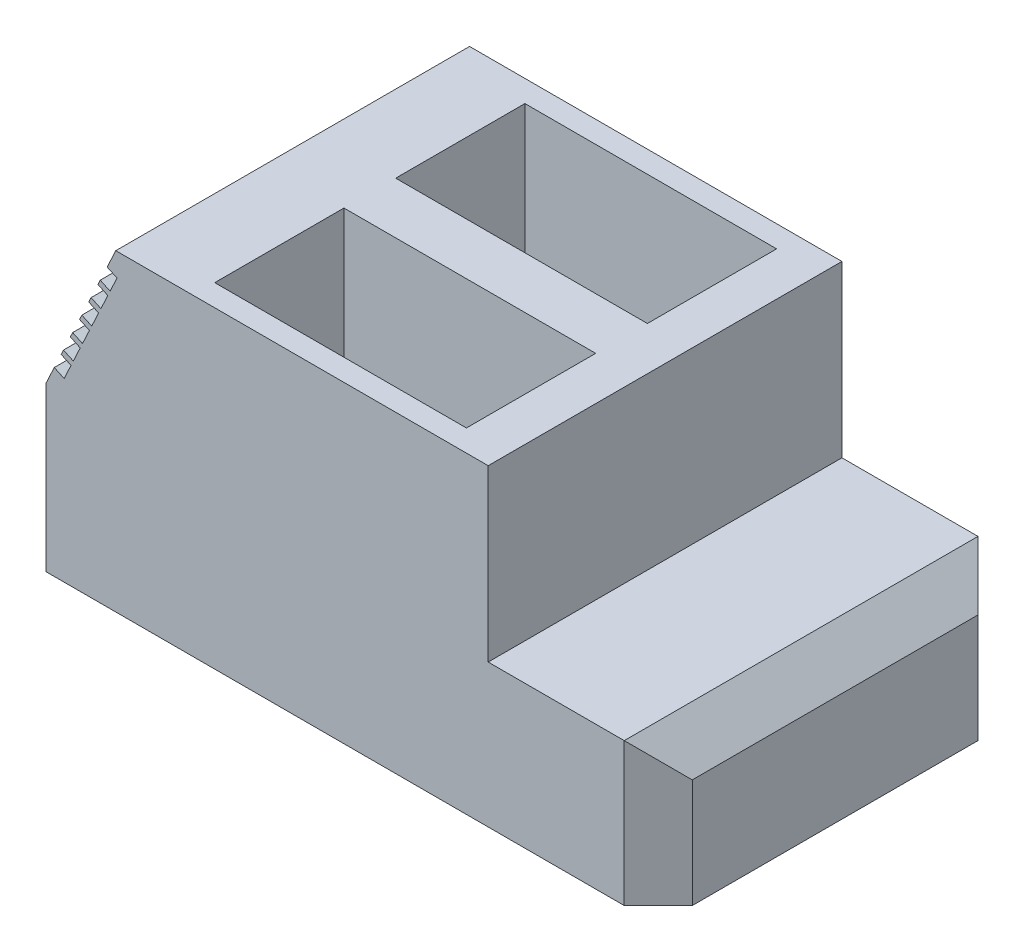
from build123d import *

# Parameters (mm, degrees)
BOSS_EXTRUDE1_DEPTH  = 130
SKETCH2_W            = 185
SKETCH2_H            = 95
CUT_EXTRUDE1_DEPTH   = 348.023053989
CUT_EXTRUDE2_DEPTH   = 80
LPATTERN1_COUNT      = 6
LPATTERN1_PITCH      = 16
MIRROR1_COPY_1_DEPTH = 80
MIRROR1_COPY_2_DEPTH = 80
MIRROR1_COPY_3_DEPTH = 80
MIRROR1_COPY_4_DEPTH = 80
MIRROR1_COPY_5_DEPTH = 80
CHAMFER1_SIZE        = 25
SKETCH7_W            = 80
SKETCH7_H            = 160
SKETCH7_W_2          = 50
SKETCH7_H_2          = 120
CUT_EXTRUDE3_DEPTH   = 70
FILLET1_R            = 12


with BuildPart() as part:
    # Sketch1 → Boss-Extrude1 (new, symmetric)
    with BuildSketch(Plane.XY):
        Polygon((-225, 120), (-173.706157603, 230), (100, 230), (100, 105), (225, 105), (225, 0), (-225, 0), align=None)
    extrude(amount=BOSS_EXTRUDE1_DEPTH, both=True)

    # Sketch2 → Cut-Extrude1 (cut, through all)
    with BuildSketch(Plane(origin=(0, 230, 0), x_dir=(1, 0, 0), z_dir=(0, 1, 0))):
        with Locations((-24.5, -66.5)):
            Rectangle(SKETCH2_W, SKETCH2_H)
    cut_extrude1 = extrude(amount=-CUT_EXTRUDE1_DEPTH, mode=Mode.SUBTRACT)

    # Sketch5 → Cut-Extrude2 (cut)
    with BuildSketch(Plane.XY.offset(130)):
        Polygon((-180.045431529, 216.405383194), (-172.794969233, 213.024437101), (-177.866388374, 202.148743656), (-185.11685067, 205.52968975), align=None)
    cut_extrude2 = extrude(amount=-CUT_EXTRUDE2_DEPTH, mode=Mode.SUBTRACT)

    # LPattern1: Cut-Extrude2 ×6
    with Locations(*[Vector(-0.4226182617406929, -0.9063077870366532, 0) * (i * LPATTERN1_PITCH) for i in range(1, LPATTERN1_COUNT)]):
        add(cut_extrude2, mode=Mode.SUBTRACT)

    # Mirror1: Cut-Extrude1, Cut-Extrude2 across plane
    add(cut_extrude1.mirror(Plane.XY), mode=Mode.SUBTRACT)
    add(cut_extrude2.mirror(Plane.XY), mode=Mode.SUBTRACT)

    # Mirror1 copy 1 sketch → Mirror1 copy 1 (cut)
    with BuildSketch(Plane(origin=(-6.761892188, -14.500924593, -130), x_dir=(1, 0, 0), z_dir=(0, 0, -1))):
        Polygon((-180.045431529, -216.405383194), (-172.794969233, -213.024437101), (-177.866388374, -202.148743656), (-185.11685067, -205.52968975), align=None)
    extrude(amount=-MIRROR1_COPY_1_DEPTH, mode=Mode.SUBTRACT)

    # Mirror1 copy 2 sketch → Mirror1 copy 2 (cut)
    with BuildSketch(Plane(origin=(-13.523784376, -29.001849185, -130), x_dir=(1, 0, 0), z_dir=(0, 0, -1))):
        Polygon((-180.045431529, -216.405383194), (-172.794969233, -213.024437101), (-177.866388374, -202.148743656), (-185.11685067, -205.52968975), align=None)
    extrude(amount=-MIRROR1_COPY_2_DEPTH, mode=Mode.SUBTRACT)

    # Mirror1 copy 3 sketch → Mirror1 copy 3 (cut)
    with BuildSketch(Plane(origin=(-20.285676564, -43.502773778, -130), x_dir=(1, 0, 0), z_dir=(0, 0, -1))):
        Polygon((-180.045431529, -216.405383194), (-172.794969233, -213.024437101), (-177.866388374, -202.148743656), (-185.11685067, -205.52968975), align=None)
    extrude(amount=-MIRROR1_COPY_3_DEPTH, mode=Mode.SUBTRACT)

    # Mirror1 copy 4 sketch → Mirror1 copy 4 (cut)
    with BuildSketch(Plane(origin=(-27.047568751, -58.00369837, -130), x_dir=(1, 0, 0), z_dir=(0, 0, -1))):
        Polygon((-180.045431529, -216.405383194), (-172.794969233, -213.024437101), (-177.866388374, -202.148743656), (-185.11685067, -205.52968975), align=None)
    extrude(amount=-MIRROR1_COPY_4_DEPTH, mode=Mode.SUBTRACT)

    # Mirror1 copy 5 sketch → Mirror1 copy 5 (cut)
    with BuildSketch(Plane(origin=(-33.809460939, -72.504622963, -130), x_dir=(1, 0, 0), z_dir=(0, 0, -1))):
        Polygon((-180.045431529, -216.405383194), (-172.794969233, -213.024437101), (-177.866388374, -202.148743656), (-185.11685067, -205.52968975), align=None)
    extrude(amount=-MIRROR1_COPY_5_DEPTH, mode=Mode.SUBTRACT)

    # Chamfer1
    chamfer1_edges = [part.edges().sort_by_distance(p)[0] for p in [
        (225, 105, 0),
        (225, 52.5, 130),
        (225, 52.5, -130),
    ]]
    chamfer(chamfer1_edges, length=CHAMFER1_SIZE)

    # Sketch7 → Cut-Extrude3 (cut)
    with BuildSketch(Plane.XZ):
        with Locations((158, 0)):
            Rectangle(SKETCH7_W, SKETCH7_H)
        with Locations((-160, 0)):
            Rectangle(SKETCH7_W_2, SKETCH7_H_2)
    extrude(amount=-CUT_EXTRUDE3_DEPTH, mode=Mode.SUBTRACT)

    # Fillet1
    fillet1_edges = [part.edges().sort_by_distance(p)[0] for p in [
        (118, 35, -80),
        (118, 35, 80),
        (198, 35, 80),
        (198, 35, -80),
        (-185, 35, -60),
        (-185, 35, 60),
        (-135, 35, 60),
        (-135, 35, -60),
    ]]
    fillet(fillet1_edges, radius=FILLET1_R)


solid = part.part
